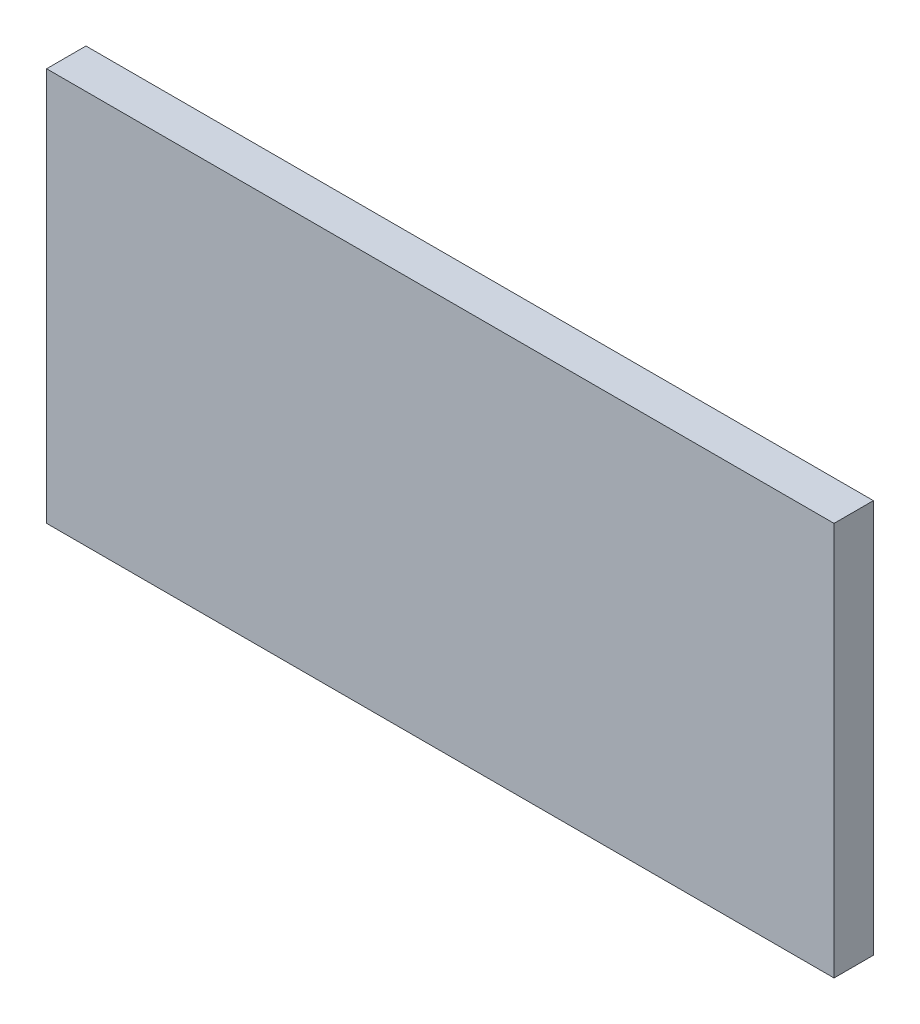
from build123d import *

# Parameters (mm, degrees)
SKIZZE1_W               = 100
SKIZZE1_H               = 50
LINEAR_AUSTRAGEN1_DEPTH = 5


with BuildPart() as part:
    # Skizze1 → Linear austragen1 (new body)
    with BuildSketch(Plane.XY):
        with Locations((0, 25)):
            Rectangle(SKIZZE1_W, SKIZZE1_H)
    extrude(amount=LINEAR_AUSTRAGEN1_DEPTH)


solid = part.part
